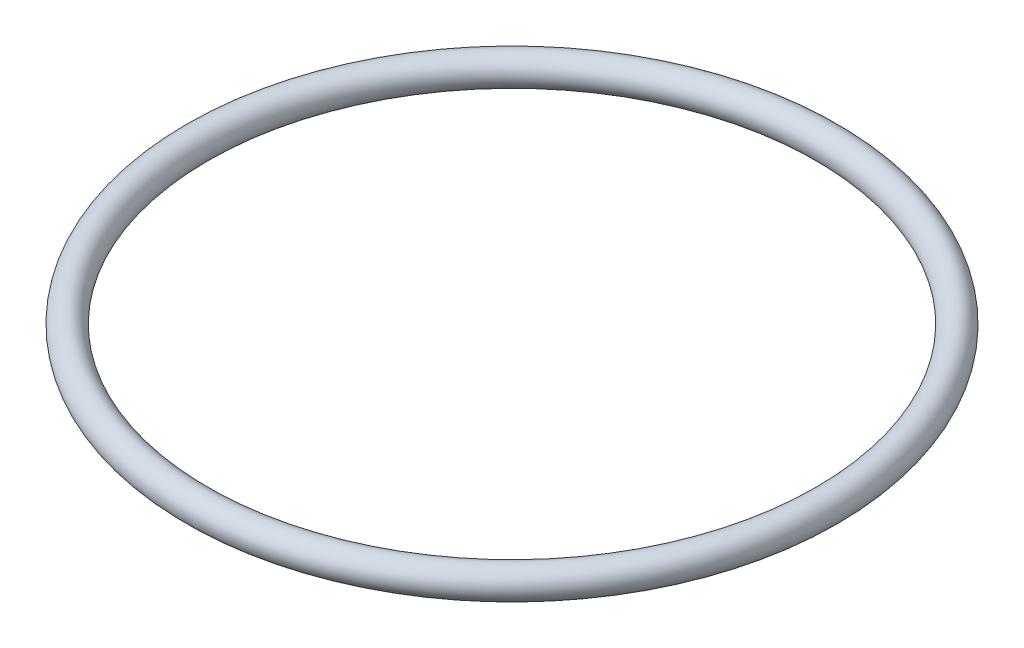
ISO-10303-21;
HEADER;
FILE_DESCRIPTION(('STEP AP214'),'2;1');
FILE_NAME('part.step','',(''),(''),'','','');
FILE_SCHEMA(('AUTOMOTIVE_DESIGN { 1 0 10303 214 1 1 1 1 }'));
ENDSEC;
DATA;
#1=APPLICATION_CONTEXT('core data for automotive mechanical design processes');
#2=APPLICATION_PROTOCOL_DEFINITION('international standard','automotive_design',2000,#1);
#3=PRODUCT_CONTEXT('',#1,'mechanical');
#4=PRODUCT('Part','Part','',(#3));
#5=PRODUCT_RELATED_PRODUCT_CATEGORY('part','',(#4));
#6=PRODUCT_DEFINITION_FORMATION('','',#4);
#7=PRODUCT_DEFINITION_CONTEXT('part definition',#1,'design');
#8=PRODUCT_DEFINITION('design','',#6,#7);
#9=PRODUCT_DEFINITION_SHAPE('','',#8);
#10=(LENGTH_UNIT() NAMED_UNIT(*) SI_UNIT(.MILLI.,.METRE.));
#11=(NAMED_UNIT(*) PLANE_ANGLE_UNIT() SI_UNIT($,.RADIAN.));
#12=(NAMED_UNIT(*) SI_UNIT($,.STERADIAN.) SOLID_ANGLE_UNIT());
#13=UNCERTAINTY_MEASURE_WITH_UNIT(LENGTH_MEASURE(1.E-05),#10,'distance_accuracy_value','');
#14=(GEOMETRIC_REPRESENTATION_CONTEXT(3) GLOBAL_UNCERTAINTY_ASSIGNED_CONTEXT((#13)) GLOBAL_UNIT_ASSIGNED_CONTEXT((#10,
#11,#12)) REPRESENTATION_CONTEXT('',''));
#15=CARTESIAN_POINT('',(0.,0.,0.));
#16=DIRECTION('',(0.,0.,1.));
#17=DIRECTION('',(1.,0.,0.));
#18=AXIS2_PLACEMENT_3D('',#15,#16,#17);
#19=CARTESIAN_POINT('',(0.,1.5,0.));
#20=DIRECTION('',(0.,1.,0.));
#21=DIRECTION('',(1.,0.,0.));
#22=AXIS2_PLACEMENT_3D('',#19,#20,#21);
#23=TOROIDAL_SURFACE('',#22,31.5,1.5);
#24=ADVANCED_FACE('F13',(),#23,.T.);
#25=CLOSED_SHELL('',(#24));
#26=MANIFOLD_SOLID_BREP('B1',#25);
#27=ADVANCED_BREP_SHAPE_REPRESENTATION('',(#18,#26),#14);
#28=SHAPE_DEFINITION_REPRESENTATION(#9,#27);
ENDSEC;
END-ISO-10303-21;
